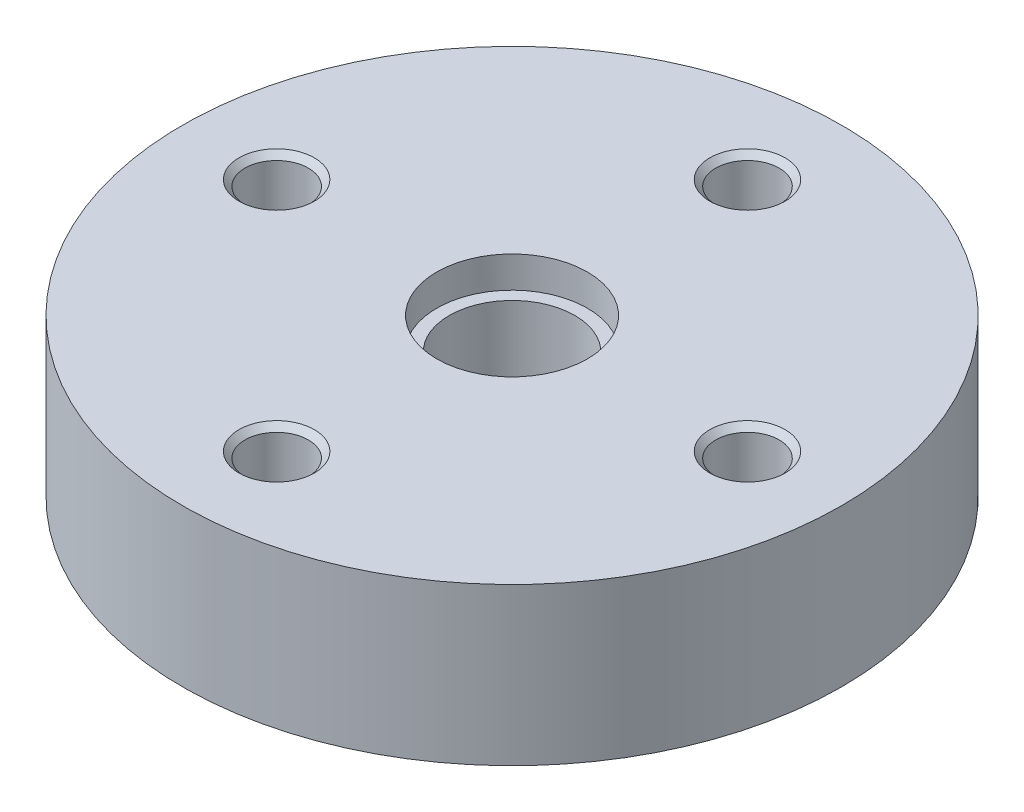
ISO-10303-21;
HEADER;
FILE_DESCRIPTION(('STEP AP214'),'2;1');
FILE_NAME('part.step','',(''),(''),'','','');
FILE_SCHEMA(('AUTOMOTIVE_DESIGN { 1 0 10303 214 1 1 1 1 }'));
ENDSEC;
DATA;
#1=APPLICATION_CONTEXT('core data for automotive mechanical design processes');
#2=APPLICATION_PROTOCOL_DEFINITION('international standard','automotive_design',2000,#1);
#3=PRODUCT_CONTEXT('',#1,'mechanical');
#4=PRODUCT('Part','Part','',(#3));
#5=PRODUCT_RELATED_PRODUCT_CATEGORY('part','',(#4));
#6=PRODUCT_DEFINITION_FORMATION('','',#4);
#7=PRODUCT_DEFINITION_CONTEXT('part definition',#1,'design');
#8=PRODUCT_DEFINITION('design','',#6,#7);
#9=PRODUCT_DEFINITION_SHAPE('','',#8);
#10=(LENGTH_UNIT() NAMED_UNIT(*) SI_UNIT(.MILLI.,.METRE.));
#11=(NAMED_UNIT(*) PLANE_ANGLE_UNIT() SI_UNIT($,.RADIAN.));
#12=(NAMED_UNIT(*) SI_UNIT($,.STERADIAN.) SOLID_ANGLE_UNIT());
#13=UNCERTAINTY_MEASURE_WITH_UNIT(LENGTH_MEASURE(1.E-05),#10,'distance_accuracy_value','');
#14=(GEOMETRIC_REPRESENTATION_CONTEXT(3) GLOBAL_UNCERTAINTY_ASSIGNED_CONTEXT((#13)) GLOBAL_UNIT_ASSIGNED_CONTEXT((#10,
#11,#12)) REPRESENTATION_CONTEXT('',''));
#15=CARTESIAN_POINT('',(0.,0.,0.));
#16=DIRECTION('',(0.,0.,1.));
#17=DIRECTION('',(1.,0.,0.));
#18=AXIS2_PLACEMENT_3D('',#15,#16,#17);
#19=CARTESIAN_POINT('',(0.,12.5,0.));
#20=DIRECTION('',(0.,-1.,0.));
#21=DIRECTION('',(1.,0.,0.));
#22=AXIS2_PLACEMENT_3D('',#19,#20,#21);
#23=CYLINDRICAL_SURFACE('',#22,52.5);
#24=CARTESIAN_POINT('',(0.,0.,0.));
#25=DIRECTION('',(0.,1.,0.));
#26=DIRECTION('',(1.,0.,0.));
#27=AXIS2_PLACEMENT_3D('',#24,#25,#26);
#28=CIRCLE('',#27,52.5);
#29=CARTESIAN_POINT('',(52.5,0.,0.));
#30=VERTEX_POINT('',#29);
#31=EDGE_CURVE('E9',#30,#30,#28,.T.);
#32=ORIENTED_EDGE('',*,*,#31,.T.);
#33=EDGE_LOOP('',(#32));
#34=FACE_BOUND('',#33,.T.);
#35=CARTESIAN_POINT('',(0.,25.,0.));
#36=DIRECTION('',(0.,1.,0.));
#37=DIRECTION('',(1.,0.,0.));
#38=AXIS2_PLACEMENT_3D('',#35,#36,#37);
#39=CIRCLE('',#38,52.5);
#40=CARTESIAN_POINT('',(52.5,25.,0.));
#41=VERTEX_POINT('',#40);
#42=EDGE_CURVE('E143',#41,#41,#39,.T.);
#43=ORIENTED_EDGE('',*,*,#42,.F.);
#44=EDGE_LOOP('',(#43));
#45=FACE_BOUND('',#44,.T.);
#46=ADVANCED_FACE('F15',(#34,#45),#23,.T.);
#47=CARTESIAN_POINT('',(31.25,0.,0.));
#48=DIRECTION('',(0.,-1.,0.));
#49=DIRECTION('',(-1.,0.,0.));
#50=AXIS2_PLACEMENT_3D('',#47,#48,#49);
#51=PLANE('',#50);
#52=CARTESIAN_POINT('',(0.,0.,0.));
#53=DIRECTION('',(0.,1.,0.));
#54=DIRECTION('',(1.,0.,0.));
#55=AXIS2_PLACEMENT_3D('',#52,#53,#54);
#56=CIRCLE('',#55,10.);
#57=CARTESIAN_POINT('',(10.,0.,0.));
#58=VERTEX_POINT('',#57);
#59=EDGE_CURVE('E22',#58,#58,#56,.T.);
#60=ORIENTED_EDGE('',*,*,#59,.T.);
#61=EDGE_LOOP('',(#60));
#62=FACE_BOUND('',#61,.T.);
#63=ORIENTED_EDGE('',*,*,#31,.F.);
#64=EDGE_LOOP('',(#63));
#65=FACE_BOUND('',#64,.T.);
#66=ADVANCED_FACE('F150',(#62,#65),#51,.T.);
#67=CARTESIAN_POINT('',(0.,12.5,0.));
#68=DIRECTION('',(0.,-1.,0.));
#69=DIRECTION('',(1.,0.,0.));
#70=AXIS2_PLACEMENT_3D('',#67,#68,#69);
#71=CYLINDRICAL_SURFACE('',#70,10.);
#72=ORIENTED_EDGE('',*,*,#59,.F.);
#73=EDGE_LOOP('',(#72));
#74=FACE_BOUND('',#73,.T.);
#75=CARTESIAN_POINT('',(0.,20.,0.));
#76=DIRECTION('',(0.,1.,0.));
#77=DIRECTION('',(1.,0.,0.));
#78=AXIS2_PLACEMENT_3D('',#75,#76,#77);
#79=CIRCLE('',#78,10.);
#80=CARTESIAN_POINT('',(-10.,20.,0.));
#81=VERTEX_POINT('',#80);
#82=EDGE_CURVE('E141',#81,#81,#79,.T.);
#83=ORIENTED_EDGE('',*,*,#82,.T.);
#84=EDGE_LOOP('',(#83));
#85=FACE_BOUND('',#84,.T.);
#86=ADVANCED_FACE('F155',(#74,#85),#71,.F.);
#87=CARTESIAN_POINT('',(31.25,25.,0.));
#88=DIRECTION('',(0.,1.,0.));
#89=DIRECTION('',(1.,0.,0.));
#90=AXIS2_PLACEMENT_3D('',#87,#88,#89);
#91=PLANE('',#90);
#92=ORIENTED_EDGE('',*,*,#42,.T.);
#93=EDGE_LOOP('',(#92));
#94=FACE_BOUND('',#93,.T.);
#95=CARTESIAN_POINT('',(0.,25.,0.));
#96=DIRECTION('',(0.,-1.,0.));
#97=DIRECTION('',(1.,0.,0.));
#98=AXIS2_PLACEMENT_3D('',#95,#96,#97);
#99=CIRCLE('',#98,12.);
#100=CARTESIAN_POINT('',(-12.,25.,0.));
#101=VERTEX_POINT('',#100);
#102=EDGE_CURVE('E130',#101,#101,#99,.T.);
#103=ORIENTED_EDGE('',*,*,#102,.T.);
#104=EDGE_LOOP('',(#103));
#105=FACE_BOUND('',#104,.T.);
#106=CARTESIAN_POINT('',(37.5,25.,0.));
#107=DIRECTION('',(0.,-1.,0.));
#108=DIRECTION('',(1.,0.,0.));
#109=AXIS2_PLACEMENT_3D('',#106,#107,#108);
#110=CIRCLE('',#109,6.);
#111=CARTESIAN_POINT('',(43.5,25.,0.));
#112=VERTEX_POINT('',#111);
#113=EDGE_CURVE('E310',#112,#112,#110,.T.);
#114=ORIENTED_EDGE('',*,*,#113,.T.);
#115=EDGE_LOOP('',(#114));
#116=FACE_BOUND('',#115,.T.);
#117=CARTESIAN_POINT('',(0.,25.,-37.5));
#118=DIRECTION('',(0.,-1.,0.));
#119=DIRECTION('',(0.,0.,-1.));
#120=AXIS2_PLACEMENT_3D('',#117,#118,#119);
#121=CIRCLE('',#120,6.);
#122=CARTESIAN_POINT('',(0.,25.,-43.5));
#123=VERTEX_POINT('',#122);
#124=EDGE_CURVE('E294',#123,#123,#121,.T.);
#125=ORIENTED_EDGE('',*,*,#124,.T.);
#126=EDGE_LOOP('',(#125));
#127=FACE_BOUND('',#126,.T.);
#128=CARTESIAN_POINT('',(-37.5,25.,0.));
#129=DIRECTION('',(0.,-1.,0.));
#130=DIRECTION('',(-1.,0.,0.));
#131=AXIS2_PLACEMENT_3D('',#128,#129,#130);
#132=CIRCLE('',#131,6.);
#133=CARTESIAN_POINT('',(-43.5,25.,0.));
#134=VERTEX_POINT('',#133);
#135=EDGE_CURVE('E289',#134,#134,#132,.T.);
#136=ORIENTED_EDGE('',*,*,#135,.T.);
#137=EDGE_LOOP('',(#136));
#138=FACE_BOUND('',#137,.T.);
#139=CARTESIAN_POINT('',(0.,25.,37.5));
#140=DIRECTION('',(0.,-1.,0.));
#141=DIRECTION('',(0.,0.,1.));
#142=AXIS2_PLACEMENT_3D('',#139,#140,#141);
#143=CIRCLE('',#142,6.);
#144=CARTESIAN_POINT('',(0.,25.,43.5));
#145=VERTEX_POINT('',#144);
#146=EDGE_CURVE('E270',#145,#145,#143,.T.);
#147=ORIENTED_EDGE('',*,*,#146,.T.);
#148=EDGE_LOOP('',(#147));
#149=FACE_BOUND('',#148,.T.);
#150=ADVANCED_FACE('F146',(#94,#105,#116,#127,#138,#149),#91,.T.);
#151=CARTESIAN_POINT('',(0.,20.,0.));
#152=DIRECTION('',(0.,-1.,0.));
#153=DIRECTION('',(-1.,0.,0.));
#154=AXIS2_PLACEMENT_3D('',#151,#152,#153);
#155=PLANE('',#154);
#156=CARTESIAN_POINT('',(0.,20.,0.));
#157=DIRECTION('',(0.,-1.,0.));
#158=DIRECTION('',(1.,0.,0.));
#159=AXIS2_PLACEMENT_3D('',#156,#157,#158);
#160=CIRCLE('',#159,12.);
#161=CARTESIAN_POINT('',(12.,20.,0.));
#162=VERTEX_POINT('',#161);
#163=EDGE_CURVE('E133',#162,#162,#160,.T.);
#164=ORIENTED_EDGE('',*,*,#163,.F.);
#165=EDGE_LOOP('',(#164));
#166=FACE_BOUND('',#165,.T.);
#167=ORIENTED_EDGE('',*,*,#82,.F.);
#168=EDGE_LOOP('',(#167));
#169=FACE_BOUND('',#168,.T.);
#170=ADVANCED_FACE('F165',(#166,#169),#155,.F.);
#171=CARTESIAN_POINT('',(0.,23.75,0.));
#172=DIRECTION('',(0.,-1.,0.));
#173=DIRECTION('',(1.,0.,0.));
#174=AXIS2_PLACEMENT_3D('',#171,#172,#173);
#175=CYLINDRICAL_SURFACE('',#174,12.);
#176=ORIENTED_EDGE('',*,*,#163,.T.);
#177=EDGE_LOOP('',(#176));
#178=FACE_BOUND('',#177,.T.);
#179=ORIENTED_EDGE('',*,*,#102,.F.);
#180=EDGE_LOOP('',(#179));
#181=FACE_BOUND('',#180,.T.);
#182=ADVANCED_FACE('F168',(#178,#181),#175,.F.);
#183=CARTESIAN_POINT('',(37.5,5.54137867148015,0.));
#184=DIRECTION('',(0.,1.,0.));
#185=DIRECTION('',(1.,0.,0.));
#186=AXIS2_PLACEMENT_3D('',#183,#184,#185);
#187=CONICAL_SURFACE('',#186,2.52640625,1.0471975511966);
#188=CARTESIAN_POINT('',(37.5,7.,0.));
#189=DIRECTION('',(0.,-1.,0.));
#190=DIRECTION('',(1.,0.,0.));
#191=AXIS2_PLACEMENT_3D('',#188,#189,#190);
#192=CIRCLE('',#191,5.0528125);
#193=CARTESIAN_POINT('',(42.5528125,7.,0.));
#194=VERTEX_POINT('',#193);
#195=EDGE_CURVE('E127',#194,#194,#192,.T.);
#196=ORIENTED_EDGE('',*,*,#195,.F.);
#197=EDGE_LOOP('',(#196));
#198=FACE_BOUND('',#197,.T.);
#199=CARTESIAN_POINT('',(37.5,4.08275734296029,0.));
#200=VERTEX_POINT('',#199);
#201=VERTEX_LOOP('',#200);
#202=FACE_BOUND('',#201,.T.);
#203=ADVANCED_FACE('F172',(#198,#202),#187,.F.);
#204=CARTESIAN_POINT('',(37.5,9.52640625,0.));
#205=DIRECTION('',(0.,1.,0.));
#206=DIRECTION('',(1.,0.,0.));
#207=AXIS2_PLACEMENT_3D('',#204,#205,#206);
#208=CYLINDRICAL_SURFACE('',#207,5.0528125);
#209=CARTESIAN_POINT('',(37.5,12.0528125,0.));
#210=DIRECTION('',(0.,-1.,0.));
#211=DIRECTION('',(1.,0.,0.));
#212=AXIS2_PLACEMENT_3D('',#209,#210,#211);
#213=CIRCLE('',#212,5.0528125);
#214=CARTESIAN_POINT('',(42.5528125,12.0528125,0.));
#215=VERTEX_POINT('',#214);
#216=EDGE_CURVE('E131',#215,#215,#213,.T.);
#217=ORIENTED_EDGE('',*,*,#216,.F.);
#218=EDGE_LOOP('',(#217));
#219=FACE_BOUND('',#218,.T.);
#220=ORIENTED_EDGE('',*,*,#195,.T.);
#221=EDGE_LOOP('',(#220));
#222=FACE_BOUND('',#221,.T.);
#223=ADVANCED_FACE('F128',(#219,#222),#208,.F.);
#224=CARTESIAN_POINT('',(37.5,12.52640625,0.));
#225=DIRECTION('',(0.,1.,0.));
#226=DIRECTION('',(1.,0.,0.));
#227=AXIS2_PLACEMENT_3D('',#224,#225,#226);
#228=CONICAL_SURFACE('',#227,5.52640625,0.785398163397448);
#229=CARTESIAN_POINT('',(37.5,13.,0.));
#230=DIRECTION('',(0.,-1.,0.));
#231=DIRECTION('',(1.,0.,0.));
#232=AXIS2_PLACEMENT_3D('',#229,#230,#231);
#233=CIRCLE('',#232,6.);
#234=CARTESIAN_POINT('',(43.5,13.,0.));
#235=VERTEX_POINT('',#234);
#236=EDGE_CURVE('E135',#235,#235,#233,.T.);
#237=ORIENTED_EDGE('',*,*,#236,.F.);
#238=EDGE_LOOP('',(#237));
#239=FACE_BOUND('',#238,.T.);
#240=ORIENTED_EDGE('',*,*,#216,.T.);
#241=EDGE_LOOP('',(#240));
#242=FACE_BOUND('',#241,.T.);
#243=ADVANCED_FACE('F178',(#239,#242),#228,.F.);
#244=CARTESIAN_POINT('',(43.02640625,13.,0.));
#245=DIRECTION('',(0.,1.,0.));
#246=DIRECTION('',(-1.,0.,0.));
#247=AXIS2_PLACEMENT_3D('',#244,#245,#246);
#248=PLANE('',#247);
#249=CARTESIAN_POINT('',(37.5,13.,0.));
#250=DIRECTION('',(0.,-1.,0.));
#251=DIRECTION('',(1.,0.,0.));
#252=AXIS2_PLACEMENT_3D('',#249,#250,#251);
#253=CIRCLE('',#252,5.0528125);
#254=CARTESIAN_POINT('',(42.5528125,13.,0.));
#255=VERTEX_POINT('',#254);
#256=EDGE_CURVE('E311',#255,#255,#253,.T.);
#257=ORIENTED_EDGE('',*,*,#256,.F.);
#258=EDGE_LOOP('',(#257));
#259=FACE_BOUND('',#258,.T.);
#260=ORIENTED_EDGE('',*,*,#236,.T.);
#261=EDGE_LOOP('',(#260));
#262=FACE_BOUND('',#261,.T.);
#263=ADVANCED_FACE('F182',(#259,#262),#248,.F.);
#264=CARTESIAN_POINT('',(37.5,18.52640625,0.));
#265=DIRECTION('',(0.,1.,0.));
#266=DIRECTION('',(1.,0.,0.));
#267=AXIS2_PLACEMENT_3D('',#264,#265,#266);
#268=CYLINDRICAL_SURFACE('',#267,5.0528125);
#269=CARTESIAN_POINT('',(37.5,24.0528125,0.));
#270=DIRECTION('',(0.,-1.,0.));
#271=DIRECTION('',(1.,0.,0.));
#272=AXIS2_PLACEMENT_3D('',#269,#270,#271);
#273=CIRCLE('',#272,5.0528125);
#274=CARTESIAN_POINT('',(42.5528125,24.0528125,0.));
#275=VERTEX_POINT('',#274);
#276=EDGE_CURVE('E308',#275,#275,#273,.T.);
#277=ORIENTED_EDGE('',*,*,#276,.F.);
#278=EDGE_LOOP('',(#277));
#279=FACE_BOUND('',#278,.T.);
#280=ORIENTED_EDGE('',*,*,#256,.T.);
#281=EDGE_LOOP('',(#280));
#282=FACE_BOUND('',#281,.T.);
#283=ADVANCED_FACE('F186',(#279,#282),#268,.F.);
#284=CARTESIAN_POINT('',(37.5,24.52640625,0.));
#285=DIRECTION('',(0.,1.,0.));
#286=DIRECTION('',(1.,0.,0.));
#287=AXIS2_PLACEMENT_3D('',#284,#285,#286);
#288=CONICAL_SURFACE('',#287,5.52640625,0.785398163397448);
#289=ORIENTED_EDGE('',*,*,#113,.F.);
#290=EDGE_LOOP('',(#289));
#291=FACE_BOUND('',#290,.T.);
#292=ORIENTED_EDGE('',*,*,#276,.T.);
#293=EDGE_LOOP('',(#292));
#294=FACE_BOUND('',#293,.T.);
#295=ADVANCED_FACE('F190',(#291,#294),#288,.F.);
#296=CARTESIAN_POINT('',(0.,5.54137867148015,-37.5));
#297=DIRECTION('',(0.,1.,0.));
#298=DIRECTION('',(0.,0.,-1.));
#299=AXIS2_PLACEMENT_3D('',#296,#297,#298);
#300=CONICAL_SURFACE('',#299,2.52640625,1.0471975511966);
#301=CARTESIAN_POINT('',(0.,7.,-37.5));
#302=DIRECTION('',(0.,-1.,0.));
#303=DIRECTION('',(0.,0.,-1.));
#304=AXIS2_PLACEMENT_3D('',#301,#302,#303);
#305=CIRCLE('',#304,5.0528125);
#306=CARTESIAN_POINT('',(0.,7.,-42.5528125));
#307=VERTEX_POINT('',#306);
#308=EDGE_CURVE('E306',#307,#307,#305,.T.);
#309=ORIENTED_EDGE('',*,*,#308,.F.);
#310=EDGE_LOOP('',(#309));
#311=FACE_BOUND('',#310,.T.);
#312=CARTESIAN_POINT('',(0.,4.08275734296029,-37.5));
#313=VERTEX_POINT('',#312);
#314=VERTEX_LOOP('',#313);
#315=FACE_BOUND('',#314,.T.);
#316=ADVANCED_FACE('F194',(#311,#315),#300,.F.);
#317=CARTESIAN_POINT('',(0.,9.52640625,-37.5));
#318=DIRECTION('',(0.,1.,0.));
#319=DIRECTION('',(0.,0.,-1.));
#320=AXIS2_PLACEMENT_3D('',#317,#318,#319);
#321=CYLINDRICAL_SURFACE('',#320,5.0528125);
#322=CARTESIAN_POINT('',(0.,12.0528125,-37.5));
#323=DIRECTION('',(0.,-1.,0.));
#324=DIRECTION('',(0.,0.,-1.));
#325=AXIS2_PLACEMENT_3D('',#322,#323,#324);
#326=CIRCLE('',#325,5.0528125);
#327=CARTESIAN_POINT('',(0.,12.0528125,-42.5528125));
#328=VERTEX_POINT('',#327);
#329=EDGE_CURVE('E280',#328,#328,#326,.T.);
#330=ORIENTED_EDGE('',*,*,#329,.F.);
#331=EDGE_LOOP('',(#330));
#332=FACE_BOUND('',#331,.T.);
#333=ORIENTED_EDGE('',*,*,#308,.T.);
#334=EDGE_LOOP('',(#333));
#335=FACE_BOUND('',#334,.T.);
#336=ADVANCED_FACE('F198',(#332,#335),#321,.F.);
#337=CARTESIAN_POINT('',(0.,12.52640625,-37.5));
#338=DIRECTION('',(0.,1.,0.));
#339=DIRECTION('',(0.,0.,-1.));
#340=AXIS2_PLACEMENT_3D('',#337,#338,#339);
#341=CONICAL_SURFACE('',#340,5.52640625,0.785398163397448);
#342=CARTESIAN_POINT('',(0.,13.,-37.5));
#343=DIRECTION('',(0.,-1.,0.));
#344=DIRECTION('',(0.,0.,-1.));
#345=AXIS2_PLACEMENT_3D('',#342,#343,#344);
#346=CIRCLE('',#345,6.);
#347=CARTESIAN_POINT('',(0.,13.,-43.5));
#348=VERTEX_POINT('',#347);
#349=EDGE_CURVE('E279',#348,#348,#346,.T.);
#350=ORIENTED_EDGE('',*,*,#349,.F.);
#351=EDGE_LOOP('',(#350));
#352=FACE_BOUND('',#351,.T.);
#353=ORIENTED_EDGE('',*,*,#329,.T.);
#354=EDGE_LOOP('',(#353));
#355=FACE_BOUND('',#354,.T.);
#356=ADVANCED_FACE('F202',(#352,#355),#341,.F.);
#357=CARTESIAN_POINT('',(0.,13.,-43.02640625));
#358=DIRECTION('',(0.,1.,0.));
#359=DIRECTION('',(0.,0.,1.));
#360=AXIS2_PLACEMENT_3D('',#357,#358,#359);
#361=PLANE('',#360);
#362=CARTESIAN_POINT('',(0.,13.,-37.5));
#363=DIRECTION('',(0.,-1.,0.));
#364=DIRECTION('',(0.,0.,-1.));
#365=AXIS2_PLACEMENT_3D('',#362,#363,#364);
#366=CIRCLE('',#365,5.0528125);
#367=CARTESIAN_POINT('',(0.,13.,-42.5528125));
#368=VERTEX_POINT('',#367);
#369=EDGE_CURVE('E281',#368,#368,#366,.T.);
#370=ORIENTED_EDGE('',*,*,#369,.F.);
#371=EDGE_LOOP('',(#370));
#372=FACE_BOUND('',#371,.T.);
#373=ORIENTED_EDGE('',*,*,#349,.T.);
#374=EDGE_LOOP('',(#373));
#375=FACE_BOUND('',#374,.T.);
#376=ADVANCED_FACE('F206',(#372,#375),#361,.F.);
#377=CARTESIAN_POINT('',(0.,18.52640625,-37.5));
#378=DIRECTION('',(0.,1.,0.));
#379=DIRECTION('',(0.,0.,-1.));
#380=AXIS2_PLACEMENT_3D('',#377,#378,#379);
#381=CYLINDRICAL_SURFACE('',#380,5.0528125);
#382=CARTESIAN_POINT('',(0.,24.0528125,-37.5));
#383=DIRECTION('',(0.,-1.,0.));
#384=DIRECTION('',(0.,0.,-1.));
#385=AXIS2_PLACEMENT_3D('',#382,#383,#384);
#386=CIRCLE('',#385,5.0528125);
#387=CARTESIAN_POINT('',(0.,24.0528125,-42.5528125));
#388=VERTEX_POINT('',#387);
#389=EDGE_CURVE('E296',#388,#388,#386,.T.);
#390=ORIENTED_EDGE('',*,*,#389,.F.);
#391=EDGE_LOOP('',(#390));
#392=FACE_BOUND('',#391,.T.);
#393=ORIENTED_EDGE('',*,*,#369,.T.);
#394=EDGE_LOOP('',(#393));
#395=FACE_BOUND('',#394,.T.);
#396=ADVANCED_FACE('F208',(#392,#395),#381,.F.);
#397=CARTESIAN_POINT('',(0.,24.52640625,-37.5));
#398=DIRECTION('',(0.,1.,0.));
#399=DIRECTION('',(0.,0.,-1.));
#400=AXIS2_PLACEMENT_3D('',#397,#398,#399);
#401=CONICAL_SURFACE('',#400,5.52640625,0.785398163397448);
#402=ORIENTED_EDGE('',*,*,#124,.F.);
#403=EDGE_LOOP('',(#402));
#404=FACE_BOUND('',#403,.T.);
#405=ORIENTED_EDGE('',*,*,#389,.T.);
#406=EDGE_LOOP('',(#405));
#407=FACE_BOUND('',#406,.T.);
#408=ADVANCED_FACE('F211',(#404,#407),#401,.F.);
#409=CARTESIAN_POINT('',(-37.5,5.54137867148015,0.));
#410=DIRECTION('',(0.,1.,0.));
#411=DIRECTION('',(-1.,0.,0.));
#412=AXIS2_PLACEMENT_3D('',#409,#410,#411);
#413=CONICAL_SURFACE('',#412,2.52640625,1.0471975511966);
#414=CARTESIAN_POINT('',(-37.5,7.,0.));
#415=DIRECTION('',(0.,-1.,0.));
#416=DIRECTION('',(-1.,0.,0.));
#417=AXIS2_PLACEMENT_3D('',#414,#415,#416);
#418=CIRCLE('',#417,5.0528125);
#419=CARTESIAN_POINT('',(-42.5528125,7.,0.));
#420=VERTEX_POINT('',#419);
#421=EDGE_CURVE('E297',#420,#420,#418,.T.);
#422=ORIENTED_EDGE('',*,*,#421,.F.);
#423=EDGE_LOOP('',(#422));
#424=FACE_BOUND('',#423,.T.);
#425=CARTESIAN_POINT('',(-37.5,4.08275734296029,0.));
#426=VERTEX_POINT('',#425);
#427=VERTEX_LOOP('',#426);
#428=FACE_BOUND('',#427,.T.);
#429=ADVANCED_FACE('F229',(#424,#428),#413,.F.);
#430=CARTESIAN_POINT('',(-37.5,9.52640625,0.));
#431=DIRECTION('',(0.,1.,0.));
#432=DIRECTION('',(-1.,0.,0.));
#433=AXIS2_PLACEMENT_3D('',#430,#431,#432);
#434=CYLINDRICAL_SURFACE('',#433,5.0528125);
#435=CARTESIAN_POINT('',(-37.5,12.0528125,0.));
#436=DIRECTION('',(0.,-1.,0.));
#437=DIRECTION('',(-1.,0.,0.));
#438=AXIS2_PLACEMENT_3D('',#435,#436,#437);
#439=CIRCLE('',#438,5.0528125);
#440=CARTESIAN_POINT('',(-42.5528125,12.0528125,0.));
#441=VERTEX_POINT('',#440);
#442=EDGE_CURVE('E299',#441,#441,#439,.T.);
#443=ORIENTED_EDGE('',*,*,#442,.F.);
#444=EDGE_LOOP('',(#443));
#445=FACE_BOUND('',#444,.T.);
#446=ORIENTED_EDGE('',*,*,#421,.T.);
#447=EDGE_LOOP('',(#446));
#448=FACE_BOUND('',#447,.T.);
#449=ADVANCED_FACE('F217',(#445,#448),#434,.F.);
#450=CARTESIAN_POINT('',(-37.5,12.52640625,0.));
#451=DIRECTION('',(0.,1.,0.));
#452=DIRECTION('',(-1.,0.,0.));
#453=AXIS2_PLACEMENT_3D('',#450,#451,#452);
#454=CONICAL_SURFACE('',#453,5.52640625,0.785398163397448);
#455=CARTESIAN_POINT('',(-37.5,13.,0.));
#456=DIRECTION('',(0.,-1.,0.));
#457=DIRECTION('',(-1.,0.,0.));
#458=AXIS2_PLACEMENT_3D('',#455,#456,#457);
#459=CIRCLE('',#458,6.);
#460=CARTESIAN_POINT('',(-43.5,13.,0.));
#461=VERTEX_POINT('',#460);
#462=EDGE_CURVE('E278',#461,#461,#459,.T.);
#463=ORIENTED_EDGE('',*,*,#462,.F.);
#464=EDGE_LOOP('',(#463));
#465=FACE_BOUND('',#464,.T.);
#466=ORIENTED_EDGE('',*,*,#442,.T.);
#467=EDGE_LOOP('',(#466));
#468=FACE_BOUND('',#467,.T.);
#469=ADVANCED_FACE('F213',(#465,#468),#454,.F.);
#470=CARTESIAN_POINT('',(-43.02640625,13.,0.));
#471=DIRECTION('',(0.,1.,0.));
#472=DIRECTION('',(1.,0.,0.));
#473=AXIS2_PLACEMENT_3D('',#470,#471,#472);
#474=PLANE('',#473);
#475=CARTESIAN_POINT('',(-37.5,13.,0.));
#476=DIRECTION('',(0.,-1.,0.));
#477=DIRECTION('',(-1.,0.,0.));
#478=AXIS2_PLACEMENT_3D('',#475,#476,#477);
#479=CIRCLE('',#478,5.0528125);
#480=CARTESIAN_POINT('',(-42.5528125,13.,0.));
#481=VERTEX_POINT('',#480);
#482=EDGE_CURVE('E291',#481,#481,#479,.T.);
#483=ORIENTED_EDGE('',*,*,#482,.F.);
#484=EDGE_LOOP('',(#483));
#485=FACE_BOUND('',#484,.T.);
#486=ORIENTED_EDGE('',*,*,#462,.T.);
#487=EDGE_LOOP('',(#486));
#488=FACE_BOUND('',#487,.T.);
#489=ADVANCED_FACE('F216',(#485,#488),#474,.F.);
#490=CARTESIAN_POINT('',(-37.5,18.52640625,0.));
#491=DIRECTION('',(0.,1.,0.));
#492=DIRECTION('',(-1.,0.,0.));
#493=AXIS2_PLACEMENT_3D('',#490,#491,#492);
#494=CYLINDRICAL_SURFACE('',#493,5.0528125);
#495=CARTESIAN_POINT('',(-37.5,24.0528125,0.));
#496=DIRECTION('',(0.,-1.,0.));
#497=DIRECTION('',(-1.,0.,0.));
#498=AXIS2_PLACEMENT_3D('',#495,#496,#497);
#499=CIRCLE('',#498,5.0528125);
#500=CARTESIAN_POINT('',(-42.5528125,24.0528125,0.));
#501=VERTEX_POINT('',#500);
#502=EDGE_CURVE('E292',#501,#501,#499,.T.);
#503=ORIENTED_EDGE('',*,*,#502,.F.);
#504=EDGE_LOOP('',(#503));
#505=FACE_BOUND('',#504,.T.);
#506=ORIENTED_EDGE('',*,*,#482,.T.);
#507=EDGE_LOOP('',(#506));
#508=FACE_BOUND('',#507,.T.);
#509=ADVANCED_FACE('F221',(#505,#508),#494,.F.);
#510=CARTESIAN_POINT('',(-37.5,24.52640625,0.));
#511=DIRECTION('',(0.,1.,0.));
#512=DIRECTION('',(-1.,0.,0.));
#513=AXIS2_PLACEMENT_3D('',#510,#511,#512);
#514=CONICAL_SURFACE('',#513,5.52640625,0.785398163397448);
#515=ORIENTED_EDGE('',*,*,#135,.F.);
#516=EDGE_LOOP('',(#515));
#517=FACE_BOUND('',#516,.T.);
#518=ORIENTED_EDGE('',*,*,#502,.T.);
#519=EDGE_LOOP('',(#518));
#520=FACE_BOUND('',#519,.T.);
#521=ADVANCED_FACE('F225',(#517,#520),#514,.F.);
#522=CARTESIAN_POINT('',(0.,5.54137867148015,37.5));
#523=DIRECTION('',(0.,1.,0.));
#524=DIRECTION('',(0.,0.,1.));
#525=AXIS2_PLACEMENT_3D('',#522,#523,#524);
#526=CONICAL_SURFACE('',#525,2.52640625,1.0471975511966);
#527=CARTESIAN_POINT('',(0.,7.,37.5));
#528=DIRECTION('',(0.,-1.,0.));
#529=DIRECTION('',(0.,0.,1.));
#530=AXIS2_PLACEMENT_3D('',#527,#528,#529);
#531=CIRCLE('',#530,5.0528125);
#532=CARTESIAN_POINT('',(0.,7.,42.5528125));
#533=VERTEX_POINT('',#532);
#534=EDGE_CURVE('E288',#533,#533,#531,.T.);
#535=ORIENTED_EDGE('',*,*,#534,.F.);
#536=EDGE_LOOP('',(#535));
#537=FACE_BOUND('',#536,.T.);
#538=CARTESIAN_POINT('',(0.,4.08275734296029,37.5));
#539=VERTEX_POINT('',#538);
#540=VERTEX_LOOP('',#539);
#541=FACE_BOUND('',#540,.T.);
#542=ADVANCED_FACE('F233',(#537,#541),#526,.F.);
#543=CARTESIAN_POINT('',(0.,9.52640625,37.5));
#544=DIRECTION('',(0.,1.,0.));
#545=DIRECTION('',(0.,0.,1.));
#546=AXIS2_PLACEMENT_3D('',#543,#544,#545);
#547=CYLINDRICAL_SURFACE('',#546,5.0528125);
#548=CARTESIAN_POINT('',(0.,12.0528125,37.5));
#549=DIRECTION('',(0.,-1.,0.));
#550=DIRECTION('',(0.,0.,1.));
#551=AXIS2_PLACEMENT_3D('',#548,#549,#550);
#552=CIRCLE('',#551,5.0528125);
#553=CARTESIAN_POINT('',(0.,12.0528125,42.5528125));
#554=VERTEX_POINT('',#553);
#555=EDGE_CURVE('E286',#554,#554,#552,.T.);
#556=ORIENTED_EDGE('',*,*,#555,.F.);
#557=EDGE_LOOP('',(#556));
#558=FACE_BOUND('',#557,.T.);
#559=ORIENTED_EDGE('',*,*,#534,.T.);
#560=EDGE_LOOP('',(#559));
#561=FACE_BOUND('',#560,.T.);
#562=ADVANCED_FACE('F240',(#558,#561),#547,.F.);
#563=CARTESIAN_POINT('',(0.,12.52640625,37.5));
#564=DIRECTION('',(0.,1.,0.));
#565=DIRECTION('',(0.,0.,1.));
#566=AXIS2_PLACEMENT_3D('',#563,#564,#565);
#567=CONICAL_SURFACE('',#566,5.52640625,0.785398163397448);
#568=CARTESIAN_POINT('',(0.,13.,37.5));
#569=DIRECTION('',(0.,-1.,0.));
#570=DIRECTION('',(0.,0.,1.));
#571=AXIS2_PLACEMENT_3D('',#568,#569,#570);
#572=CIRCLE('',#571,6.);
#573=CARTESIAN_POINT('',(0.,13.,43.5));
#574=VERTEX_POINT('',#573);
#575=EDGE_CURVE('E284',#574,#574,#572,.T.);
#576=ORIENTED_EDGE('',*,*,#575,.F.);
#577=EDGE_LOOP('',(#576));
#578=FACE_BOUND('',#577,.T.);
#579=ORIENTED_EDGE('',*,*,#555,.T.);
#580=EDGE_LOOP('',(#579));
#581=FACE_BOUND('',#580,.T.);
#582=ADVANCED_FACE('F244',(#578,#581),#567,.F.);
#583=CARTESIAN_POINT('',(0.,13.,43.02640625));
#584=DIRECTION('',(0.,1.,0.));
#585=DIRECTION('',(0.,0.,-1.));
#586=AXIS2_PLACEMENT_3D('',#583,#584,#585);
#587=PLANE('',#586);
#588=CARTESIAN_POINT('',(0.,13.,37.5));
#589=DIRECTION('',(0.,-1.,0.));
#590=DIRECTION('',(0.,0.,1.));
#591=AXIS2_PLACEMENT_3D('',#588,#589,#590);
#592=CIRCLE('',#591,5.0528125);
#593=CARTESIAN_POINT('',(0.,13.,42.5528125));
#594=VERTEX_POINT('',#593);
#595=EDGE_CURVE('E274',#594,#594,#592,.T.);
#596=ORIENTED_EDGE('',*,*,#595,.F.);
#597=EDGE_LOOP('',(#596));
#598=FACE_BOUND('',#597,.T.);
#599=ORIENTED_EDGE('',*,*,#575,.T.);
#600=EDGE_LOOP('',(#599));
#601=FACE_BOUND('',#600,.T.);
#602=ADVANCED_FACE('F248',(#598,#601),#587,.F.);
#603=CARTESIAN_POINT('',(0.,18.52640625,37.5));
#604=DIRECTION('',(0.,1.,0.));
#605=DIRECTION('',(0.,0.,1.));
#606=AXIS2_PLACEMENT_3D('',#603,#604,#605);
#607=CYLINDRICAL_SURFACE('',#606,5.0528125);
#608=CARTESIAN_POINT('',(0.,24.0528125,37.5));
#609=DIRECTION('',(0.,-1.,0.));
#610=DIRECTION('',(0.,0.,1.));
#611=AXIS2_PLACEMENT_3D('',#608,#609,#610);
#612=CIRCLE('',#611,5.0528125);
#613=CARTESIAN_POINT('',(0.,24.0528125,42.5528125));
#614=VERTEX_POINT('',#613);
#615=EDGE_CURVE('E272',#614,#614,#612,.T.);
#616=ORIENTED_EDGE('',*,*,#615,.F.);
#617=EDGE_LOOP('',(#616));
#618=FACE_BOUND('',#617,.T.);
#619=ORIENTED_EDGE('',*,*,#595,.T.);
#620=EDGE_LOOP('',(#619));
#621=FACE_BOUND('',#620,.T.);
#622=ADVANCED_FACE('F252',(#618,#621),#607,.F.);
#623=CARTESIAN_POINT('',(0.,24.52640625,37.5));
#624=DIRECTION('',(0.,1.,0.));
#625=DIRECTION('',(0.,0.,1.));
#626=AXIS2_PLACEMENT_3D('',#623,#624,#625);
#627=CONICAL_SURFACE('',#626,5.52640625,0.785398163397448);
#628=ORIENTED_EDGE('',*,*,#146,.F.);
#629=EDGE_LOOP('',(#628));
#630=FACE_BOUND('',#629,.T.);
#631=ORIENTED_EDGE('',*,*,#615,.T.);
#632=EDGE_LOOP('',(#631));
#633=FACE_BOUND('',#632,.T.);
#634=ADVANCED_FACE('F259',(#630,#633),#627,.F.);
#635=CLOSED_SHELL('',(#46,#66,#86,#150,#170,#182,#203,#223,#243,#263,#283,#295,#316,#336,#356,
#376,#396,#408,#429,#449,#469,#489,#509,#521,#542,#562,#582,#602,#622,#634));
#636=MANIFOLD_SOLID_BREP('B1',#635);
#637=ADVANCED_BREP_SHAPE_REPRESENTATION('',(#18,#636),#14);
#638=SHAPE_DEFINITION_REPRESENTATION(#9,#637);
ENDSEC;
END-ISO-10303-21;
